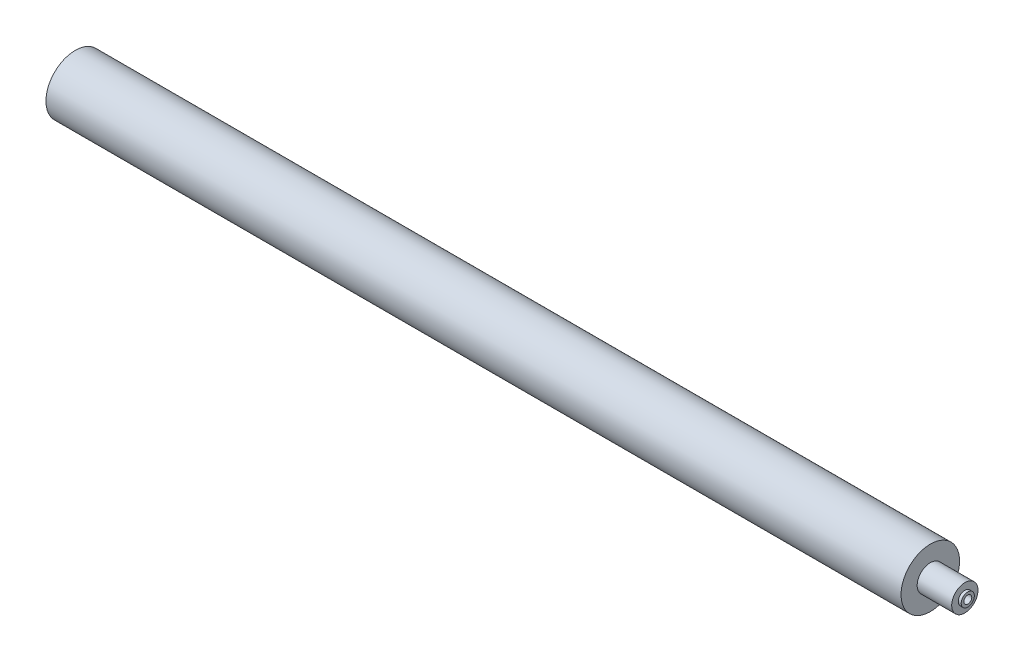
from build123d import *

# Parameters (mm, degrees)
ESQUISSE1_R             = 44.5
EXTRUSION1_DEPTH        = 1300
ESQUISSE2_R             = 10
EXTRUSION2_DEPTH        = 3
ESQUISSE8_R             = 20
EXTRUSION5_DEPTH        = 52.5
EXTRUSION6_START        = 4.5
ESQUISSE9_R             = 10
EXTRUSION6_DEPTH        = 4.5
ESQUISSE11_R            = 6
ENL_V_MAT_EXTRU_2_DEPTH = 30
ENL_V_START             = -30
ESQUISSE12_R            = 6
ENL_V_MAT_EXTRU_3_DEPTH = 30


with BuildPart() as part:
    # Esquisse1 → Extrusion1 (new body)
    with BuildSketch(Plane(origin=(0, 0, 0), x_dir=(0, 0, -1), z_dir=(1, 0, 0))):
        Circle(ESQUISSE1_R)
    extrude(amount=EXTRUSION1_DEPTH)

    # Esquisse2 → Extrusion2 (add)
    with BuildSketch(Plane.ZY):
        with Locations(Location((0, 0, 0), (0, 0, 180))):
            Circle(ESQUISSE2_R)
    extrude(amount=EXTRUSION2_DEPTH)

    # Esquisse8 → Extrusion5 (add)
    with BuildSketch(Plane(origin=(1300, 0, 0), x_dir=(0, 0, -1), z_dir=(1, 0, 0))):
        Circle(ESQUISSE8_R)
    extrude(amount=EXTRUSION5_DEPTH)

    # Esquisse9 → Extrusion6 (add)
    with BuildSketch(Plane(origin=(1352.5, 0, 0), x_dir=(0, 0, -1), z_dir=(1, 0, 0)).offset(EXTRUSION6_START)):
        Circle(ESQUISSE9_R)
    extrude(amount=-EXTRUSION6_DEPTH)

    # Esquisse11 → Enl_v. mat.-Extru.2 (cut)
    with BuildSketch(Plane.ZY.offset(3)):
        Circle(ESQUISSE11_R)
    extrude(amount=-ENL_V_MAT_EXTRU_2_DEPTH, mode=Mode.SUBTRACT)

    # Esquisse12 → Enl_v. mat.-Extru.3 (cut)
    with BuildSketch(Plane(origin=(1357, 0, 0), x_dir=(0, 0, -1), z_dir=(1, 0, 0)).offset(ENL_V_START)):
        with Locations(Location((0, 0, 0), (0, 0, 180))):
            Circle(ESQUISSE12_R)
    extrude(amount=ENL_V_MAT_EXTRU_3_DEPTH, mode=Mode.SUBTRACT)


solid = part.part
